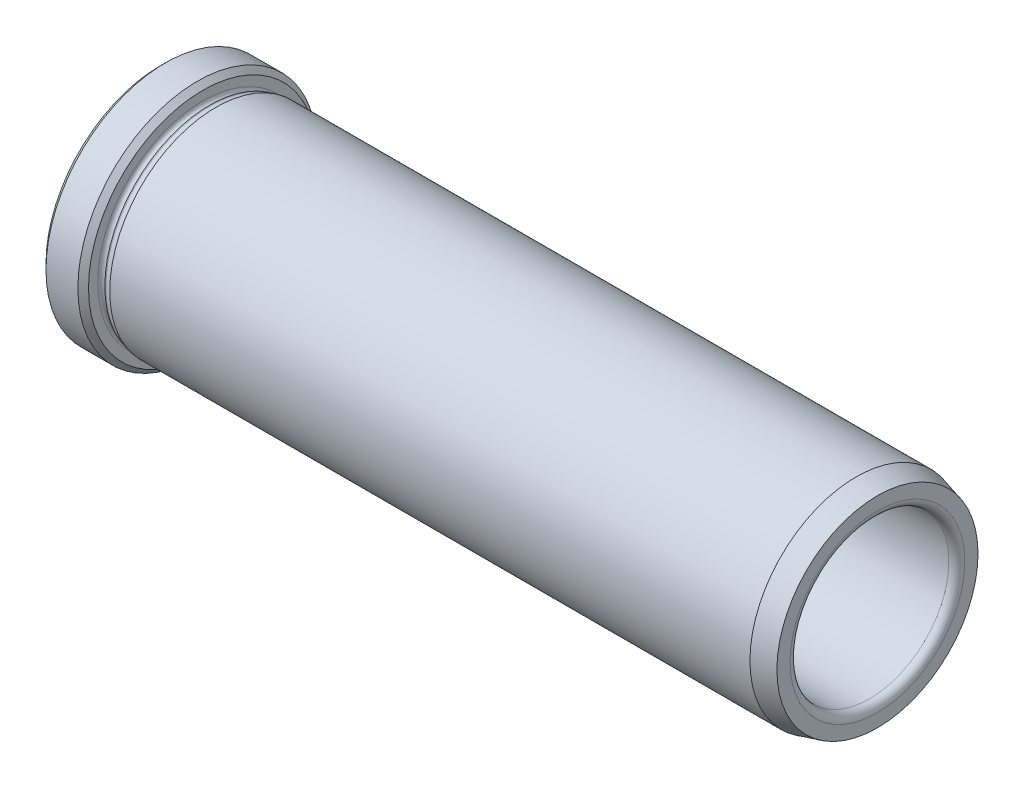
ISO-10303-21;
HEADER;
FILE_DESCRIPTION(('STEP AP214'),'2;1');
FILE_NAME('part.step','',(''),(''),'','','');
FILE_SCHEMA(('AUTOMOTIVE_DESIGN { 1 0 10303 214 1 1 1 1 }'));
ENDSEC;
DATA;
#1=APPLICATION_CONTEXT('core data for automotive mechanical design processes');
#2=APPLICATION_PROTOCOL_DEFINITION('international standard','automotive_design',2000,#1);
#3=PRODUCT_CONTEXT('',#1,'mechanical');
#4=PRODUCT('Part','Part','',(#3));
#5=PRODUCT_RELATED_PRODUCT_CATEGORY('part','',(#4));
#6=PRODUCT_DEFINITION_FORMATION('','',#4);
#7=PRODUCT_DEFINITION_CONTEXT('part definition',#1,'design');
#8=PRODUCT_DEFINITION('design','',#6,#7);
#9=PRODUCT_DEFINITION_SHAPE('','',#8);
#10=(LENGTH_UNIT() NAMED_UNIT(*) SI_UNIT(.MILLI.,.METRE.));
#11=(NAMED_UNIT(*) PLANE_ANGLE_UNIT() SI_UNIT($,.RADIAN.));
#12=(NAMED_UNIT(*) SI_UNIT($,.STERADIAN.) SOLID_ANGLE_UNIT());
#13=UNCERTAINTY_MEASURE_WITH_UNIT(LENGTH_MEASURE(1.E-05),#10,'distance_accuracy_value','');
#14=(GEOMETRIC_REPRESENTATION_CONTEXT(3) GLOBAL_UNCERTAINTY_ASSIGNED_CONTEXT((#13)) GLOBAL_UNIT_ASSIGNED_CONTEXT((#10,
#11,#12)) REPRESENTATION_CONTEXT('',''));
#15=CARTESIAN_POINT('',(0.,0.,0.));
#16=DIRECTION('',(0.,0.,1.));
#17=DIRECTION('',(1.,0.,0.));
#18=AXIS2_PLACEMENT_3D('',#15,#16,#17);
#19=CARTESIAN_POINT('',(30.9097582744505,14.95,0.));
#20=DIRECTION('',(1.,0.,0.));
#21=DIRECTION('',(0.,0.,-1.));
#22=AXIS2_PLACEMENT_3D('',#19,#20,#21);
#23=PLANE('',#22);
#24=CARTESIAN_POINT('',(30.9097582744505,0.,0.));
#25=DIRECTION('',(-1.,0.,0.));
#26=DIRECTION('',(0.,0.,1.));
#27=AXIS2_PLACEMENT_3D('',#24,#25,#26);
#28=CIRCLE('',#27,14.95);
#29=CARTESIAN_POINT('',(30.9097582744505,0.,14.95));
#30=VERTEX_POINT('',#29);
#31=EDGE_CURVE('E46',#30,#30,#28,.T.);
#32=ORIENTED_EDGE('',*,*,#31,.F.);
#33=EDGE_LOOP('',(#32));
#34=FACE_BOUND('',#33,.T.);
#35=CARTESIAN_POINT('',(30.9097582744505,0.,0.));
#36=DIRECTION('',(-1.,0.,0.));
#37=DIRECTION('',(0.,0.,1.));
#38=AXIS2_PLACEMENT_3D('',#35,#36,#37);
#39=CIRCLE('',#38,15.);
#40=CARTESIAN_POINT('',(30.9097582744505,0.,15.));
#41=VERTEX_POINT('',#40);
#42=EDGE_CURVE('E70',#41,#41,#39,.T.);
#43=ORIENTED_EDGE('',*,*,#42,.T.);
#44=EDGE_LOOP('',(#43));
#45=FACE_BOUND('',#44,.T.);
#46=ADVANCED_FACE('F14',(#34,#45),#23,.F.);
#47=CARTESIAN_POINT('',(0.,0.,0.));
#48=DIRECTION('',(-1.,0.,0.));
#49=DIRECTION('',(0.,0.,1.));
#50=AXIS2_PLACEMENT_3D('',#47,#48,#49);
#51=CYLINDRICAL_SURFACE('',#50,14.95);
#52=CARTESIAN_POINT('',(124.40975827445,0.,0.));
#53=DIRECTION('',(-1.,0.,0.));
#54=DIRECTION('',(0.,0.,1.));
#55=AXIS2_PLACEMENT_3D('',#52,#53,#54);
#56=CIRCLE('',#55,14.95);
#57=CARTESIAN_POINT('',(124.40975827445,0.,14.95));
#58=VERTEX_POINT('',#57);
#59=EDGE_CURVE('E34',#58,#58,#56,.F.);
#60=ORIENTED_EDGE('',*,*,#59,.T.);
#61=EDGE_LOOP('',(#60));
#62=FACE_BOUND('',#61,.T.);
#63=ORIENTED_EDGE('',*,*,#31,.T.);
#64=EDGE_LOOP('',(#63));
#65=FACE_BOUND('',#64,.T.);
#66=ADVANCED_FACE('F94',(#62,#65),#51,.F.);
#67=CARTESIAN_POINT('',(125.90975827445,18.9282032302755,0.));
#68=DIRECTION('',(-1.,0.,0.));
#69=DIRECTION('',(0.,0.,1.));
#70=AXIS2_PLACEMENT_3D('',#67,#68,#69);
#71=PLANE('',#70);
#72=CARTESIAN_POINT('',(125.90975827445,0.,0.));
#73=DIRECTION('',(-1.,0.,0.));
#74=DIRECTION('',(0.,0.,1.));
#75=AXIS2_PLACEMENT_3D('',#72,#73,#74);
#76=CIRCLE('',#75,16.45);
#77=CARTESIAN_POINT('',(125.90975827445,0.,16.45));
#78=VERTEX_POINT('',#77);
#79=EDGE_CURVE('E37',#78,#78,#76,.T.);
#80=ORIENTED_EDGE('',*,*,#79,.T.);
#81=EDGE_LOOP('',(#80));
#82=FACE_BOUND('',#81,.T.);
#83=CARTESIAN_POINT('',(125.90975827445,0.,0.));
#84=DIRECTION('',(-1.,0.,0.));
#85=DIRECTION('',(0.,0.,1.));
#86=AXIS2_PLACEMENT_3D('',#83,#84,#85);
#87=CIRCLE('',#86,18.9282032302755);
#88=CARTESIAN_POINT('',(125.90975827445,0.,18.9282032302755));
#89=VERTEX_POINT('',#88);
#90=EDGE_CURVE('E49',#89,#89,#87,.T.);
#91=ORIENTED_EDGE('',*,*,#90,.F.);
#92=EDGE_LOOP('',(#91));
#93=FACE_BOUND('',#92,.T.);
#94=ADVANCED_FACE('F101',(#82,#93),#71,.F.);
#95=CARTESIAN_POINT('',(125.90975827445,0.,0.));
#96=DIRECTION('',(-1.,0.,0.));
#97=DIRECTION('',(0.,0.,1.));
#98=AXIS2_PLACEMENT_3D('',#95,#96,#97);
#99=CONICAL_SURFACE('',#98,18.9282032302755,0.261799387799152);
#100=CARTESIAN_POINT('',(121.90975827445,0.,0.));
#101=DIRECTION('',(-1.,0.,0.));
#102=DIRECTION('',(0.,0.,1.));
#103=AXIS2_PLACEMENT_3D('',#100,#101,#102);
#104=CIRCLE('',#103,20.);
#105=CARTESIAN_POINT('',(121.90975827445,0.,20.));
#106=VERTEX_POINT('',#105);
#107=EDGE_CURVE('E52',#106,#106,#104,.T.);
#108=ORIENTED_EDGE('',*,*,#107,.F.);
#109=EDGE_LOOP('',(#108));
#110=FACE_BOUND('',#109,.T.);
#111=ORIENTED_EDGE('',*,*,#90,.T.);
#112=EDGE_LOOP('',(#111));
#113=FACE_BOUND('',#112,.T.);
#114=ADVANCED_FACE('F165',(#110,#113),#99,.T.);
#115=CARTESIAN_POINT('',(0.,0.,0.));
#116=DIRECTION('',(-1.,0.,0.));
#117=DIRECTION('',(0.,0.,1.));
#118=AXIS2_PLACEMENT_3D('',#115,#116,#117);
#119=CYLINDRICAL_SURFACE('',#118,20.);
#120=CARTESIAN_POINT('',(1.40975827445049,0.,0.));
#121=DIRECTION('',(-1.,0.,0.));
#122=DIRECTION('',(0.,0.,1.));
#123=AXIS2_PLACEMENT_3D('',#120,#121,#122);
#124=CIRCLE('',#123,20.);
#125=CARTESIAN_POINT('',(1.40975827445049,0.,20.));
#126=VERTEX_POINT('',#125);
#127=EDGE_CURVE('E55',#126,#126,#124,.T.);
#128=ORIENTED_EDGE('',*,*,#127,.F.);
#129=EDGE_LOOP('',(#128));
#130=FACE_BOUND('',#129,.T.);
#131=ORIENTED_EDGE('',*,*,#107,.T.);
#132=EDGE_LOOP('',(#131));
#133=FACE_BOUND('',#132,.T.);
#134=ADVANCED_FACE('F205',(#130,#133),#119,.T.);
#135=CARTESIAN_POINT('',(1.40975827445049,0.,0.));
#136=DIRECTION('',(1.,0.,0.));
#137=DIRECTION('',(0.,0.,-1.));
#138=AXIS2_PLACEMENT_3D('',#135,#136,#137);
#139=CONICAL_SURFACE('',#138,20.,0.261799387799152);
#140=CARTESIAN_POINT('',(0.391876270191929,0.,0.));
#141=DIRECTION('',(-1.,0.,0.));
#142=DIRECTION('',(0.,0.,1.));
#143=AXIS2_PLACEMENT_3D('',#140,#141,#142);
#144=CIRCLE('',#143,19.7272593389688);
#145=CARTESIAN_POINT('',(0.391876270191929,0.,19.7272593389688));
#146=VERTEX_POINT('',#145);
#147=EDGE_CURVE('E58',#146,#146,#144,.T.);
#148=ORIENTED_EDGE('',*,*,#147,.F.);
#149=EDGE_LOOP('',(#148));
#150=FACE_BOUND('',#149,.T.);
#151=ORIENTED_EDGE('',*,*,#127,.T.);
#152=EDGE_LOOP('',(#151));
#153=FACE_BOUND('',#152,.T.);
#154=ADVANCED_FACE('F195',(#150,#153),#139,.T.);
#155=CARTESIAN_POINT('',(0.184821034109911,0.,0.));
#156=DIRECTION('',(-1.,0.,0.));
#157=DIRECTION('',(0.,0.,1.));
#158=AXIS2_PLACEMENT_3D('',#155,#156,#157);
#159=TOROIDAL_SURFACE('',#158,20.5,0.8);
#160=CARTESIAN_POINT('',(0.184821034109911,0.,0.));
#161=DIRECTION('',(-1.,0.,0.));
#162=DIRECTION('',(0.,0.,1.));
#163=AXIS2_PLACEMENT_3D('',#160,#161,#162);
#164=CIRCLE('',#163,19.7);
#165=CARTESIAN_POINT('',(0.184821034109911,0.,19.7));
#166=VERTEX_POINT('',#165);
#167=EDGE_CURVE('E61',#166,#166,#164,.T.);
#168=ORIENTED_EDGE('',*,*,#167,.F.);
#169=EDGE_LOOP('',(#168));
#170=FACE_BOUND('',#169,.T.);
#171=ORIENTED_EDGE('',*,*,#147,.T.);
#172=EDGE_LOOP('',(#171));
#173=FACE_BOUND('',#172,.T.);
#174=ADVANCED_FACE('F185',(#170,#173),#159,.F.);
#175=CARTESIAN_POINT('',(0.,0.,0.));
#176=DIRECTION('',(-1.,0.,0.));
#177=DIRECTION('',(0.,0.,1.));
#178=AXIS2_PLACEMENT_3D('',#175,#176,#177);
#179=CYLINDRICAL_SURFACE('',#178,19.7);
#180=CARTESIAN_POINT('',(0.507210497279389,0.,0.));
#181=DIRECTION('',(-1.,0.,0.));
#182=DIRECTION('',(0.,0.,1.));
#183=AXIS2_PLACEMENT_3D('',#180,#181,#182);
#184=CIRCLE('',#183,19.7);
#185=CARTESIAN_POINT('',(0.507210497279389,0.,19.7));
#186=VERTEX_POINT('',#185);
#187=EDGE_CURVE('E64',#186,#186,#184,.T.);
#188=ORIENTED_EDGE('',*,*,#187,.F.);
#189=EDGE_LOOP('',(#188));
#190=FACE_BOUND('',#189,.T.);
#191=ORIENTED_EDGE('',*,*,#167,.T.);
#192=EDGE_LOOP('',(#191));
#193=FACE_BOUND('',#192,.T.);
#194=ADVANCED_FACE('F175',(#190,#193),#179,.F.);
#195=CARTESIAN_POINT('',(-0.290241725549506,0.,0.));
#196=DIRECTION('',(-1.,0.,0.));
#197=DIRECTION('',(0.,0.,1.));
#198=AXIS2_PLACEMENT_3D('',#195,#196,#197);
#199=TOROIDAL_SURFACE('',#198,19.7637961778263,0.8);
#200=CARTESIAN_POINT('',(-1.0902417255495,0.,0.));
#201=DIRECTION('',(-1.,0.,0.));
#202=DIRECTION('',(0.,0.,1.));
#203=AXIS2_PLACEMENT_3D('',#200,#201,#202);
#204=CIRCLE('',#203,19.7637961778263);
#205=CARTESIAN_POINT('',(-1.0902417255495,0.,19.7637961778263));
#206=VERTEX_POINT('',#205);
#207=EDGE_CURVE('E67',#206,#206,#204,.T.);
#208=ORIENTED_EDGE('',*,*,#207,.F.);
#209=EDGE_LOOP('',(#208));
#210=FACE_BOUND('',#209,.T.);
#211=ORIENTED_EDGE('',*,*,#187,.T.);
#212=EDGE_LOOP('',(#211));
#213=FACE_BOUND('',#212,.T.);
#214=ADVANCED_FACE('F154',(#210,#213),#199,.F.);
#215=CARTESIAN_POINT('',(-1.0902417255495,22.5,0.));
#216=DIRECTION('',(-1.,0.,0.));
#217=DIRECTION('',(0.,0.,1.));
#218=AXIS2_PLACEMENT_3D('',#215,#216,#217);
#219=PLANE('',#218);
#220=CARTESIAN_POINT('',(-1.0902417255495,0.,0.));
#221=DIRECTION('',(-1.,0.,0.));
#222=DIRECTION('',(0.,0.,1.));
#223=AXIS2_PLACEMENT_3D('',#220,#221,#222);
#224=CIRCLE('',#223,21.5);
#225=CARTESIAN_POINT('',(-1.0902417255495,0.,21.5));
#226=VERTEX_POINT('',#225);
#227=EDGE_CURVE('E9',#226,#226,#224,.F.);
#228=ORIENTED_EDGE('',*,*,#227,.T.);
#229=EDGE_LOOP('',(#228));
#230=FACE_BOUND('',#229,.T.);
#231=ORIENTED_EDGE('',*,*,#207,.T.);
#232=EDGE_LOOP('',(#231));
#233=FACE_BOUND('',#232,.T.);
#234=ADVANCED_FACE('F144',(#230,#233),#219,.F.);
#235=CARTESIAN_POINT('',(0.,0.,0.));
#236=DIRECTION('',(-1.,0.,0.));
#237=DIRECTION('',(0.,0.,1.));
#238=AXIS2_PLACEMENT_3D('',#235,#236,#237);
#239=CYLINDRICAL_SURFACE('',#238,22.5);
#240=CARTESIAN_POINT('',(-2.09024172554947,0.,0.));
#241=DIRECTION('',(-1.,0.,0.));
#242=DIRECTION('',(0.,0.,1.));
#243=AXIS2_PLACEMENT_3D('',#240,#241,#242);
#244=CIRCLE('',#243,22.5);
#245=CARTESIAN_POINT('',(-2.09024172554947,0.,22.5));
#246=VERTEX_POINT('',#245);
#247=EDGE_CURVE('E21',#246,#246,#244,.T.);
#248=ORIENTED_EDGE('',*,*,#247,.T.);
#249=EDGE_LOOP('',(#248));
#250=FACE_BOUND('',#249,.T.);
#251=CARTESIAN_POINT('',(-8.09024172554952,0.,0.));
#252=DIRECTION('',(1.,0.,0.));
#253=DIRECTION('',(0.,0.,-1.));
#254=AXIS2_PLACEMENT_3D('',#251,#252,#253);
#255=CIRCLE('',#254,22.5);
#256=CARTESIAN_POINT('',(-8.09024172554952,0.,-22.5));
#257=VERTEX_POINT('',#256);
#258=EDGE_CURVE('E40',#257,#257,#255,.T.);
#259=ORIENTED_EDGE('',*,*,#258,.T.);
#260=EDGE_LOOP('',(#259));
#261=FACE_BOUND('',#260,.T.);
#262=ADVANCED_FACE('F90',(#250,#261),#239,.T.);
#263=CARTESIAN_POINT('',(-9.09024172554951,22.5,0.));
#264=DIRECTION('',(1.,0.,0.));
#265=DIRECTION('',(0.,0.,-1.));
#266=AXIS2_PLACEMENT_3D('',#263,#264,#265);
#267=PLANE('',#266);
#268=CARTESIAN_POINT('',(-9.09024172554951,0.,0.));
#269=DIRECTION('',(1.,0.,0.));
#270=DIRECTION('',(0.,0.,-1.));
#271=AXIS2_PLACEMENT_3D('',#268,#269,#270);
#272=CIRCLE('',#271,16.5);
#273=CARTESIAN_POINT('',(-9.09024172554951,0.,-16.5));
#274=VERTEX_POINT('',#273);
#275=EDGE_CURVE('E25',#274,#274,#272,.T.);
#276=ORIENTED_EDGE('',*,*,#275,.T.);
#277=EDGE_LOOP('',(#276));
#278=FACE_BOUND('',#277,.T.);
#279=CARTESIAN_POINT('',(-9.09024172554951,0.,0.));
#280=DIRECTION('',(1.,0.,0.));
#281=DIRECTION('',(0.,0.,-1.));
#282=AXIS2_PLACEMENT_3D('',#279,#280,#281);
#283=CIRCLE('',#282,21.5);
#284=CARTESIAN_POINT('',(-9.09024172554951,0.,-21.5));
#285=VERTEX_POINT('',#284);
#286=EDGE_CURVE('E43',#285,#285,#283,.F.);
#287=ORIENTED_EDGE('',*,*,#286,.T.);
#288=EDGE_LOOP('',(#287));
#289=FACE_BOUND('',#288,.T.);
#290=ADVANCED_FACE('F78',(#278,#289),#267,.F.);
#291=CARTESIAN_POINT('',(0.,0.,0.));
#292=DIRECTION('',(-1.,0.,0.));
#293=DIRECTION('',(0.,0.,1.));
#294=AXIS2_PLACEMENT_3D('',#291,#292,#293);
#295=CYLINDRICAL_SURFACE('',#294,15.);
#296=CARTESIAN_POINT('',(-7.59024172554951,0.,0.));
#297=DIRECTION('',(1.,0.,0.));
#298=DIRECTION('',(0.,0.,-1.));
#299=AXIS2_PLACEMENT_3D('',#296,#297,#298);
#300=CIRCLE('',#299,15.);
#301=CARTESIAN_POINT('',(-7.59024172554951,0.,-15.));
#302=VERTEX_POINT('',#301);
#303=EDGE_CURVE('E29',#302,#302,#300,.F.);
#304=ORIENTED_EDGE('',*,*,#303,.T.);
#305=EDGE_LOOP('',(#304));
#306=FACE_BOUND('',#305,.T.);
#307=ORIENTED_EDGE('',*,*,#42,.F.);
#308=EDGE_LOOP('',(#307));
#309=FACE_BOUND('',#308,.T.);
#310=ADVANCED_FACE('F75',(#306,#309),#295,.F.);
#311=CARTESIAN_POINT('',(-9.09024172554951,0.,0.));
#312=DIRECTION('',(1.,0.,0.));
#313=DIRECTION('',(0.,0.,-1.));
#314=AXIS2_PLACEMENT_3D('',#311,#312,#313);
#315=CONICAL_SURFACE('',#314,21.5,0.785398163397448);
#316=ORIENTED_EDGE('',*,*,#258,.F.);
#317=EDGE_LOOP('',(#316));
#318=FACE_BOUND('',#317,.T.);
#319=ORIENTED_EDGE('',*,*,#286,.F.);
#320=EDGE_LOOP('',(#319));
#321=FACE_BOUND('',#320,.T.);
#322=ADVANCED_FACE('F77',(#318,#321),#315,.T.);
#323=CARTESIAN_POINT('',(124.40975827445,0.,0.));
#324=DIRECTION('',(-1.,0.,0.));
#325=DIRECTION('',(0.,0.,1.));
#326=AXIS2_PLACEMENT_3D('',#323,#324,#325);
#327=TOROIDAL_SURFACE('',#326,16.45,1.5);
#328=ORIENTED_EDGE('',*,*,#59,.F.);
#329=EDGE_LOOP('',(#328));
#330=FACE_BOUND('',#329,.T.);
#331=ORIENTED_EDGE('',*,*,#79,.F.);
#332=EDGE_LOOP('',(#331));
#333=FACE_BOUND('',#332,.T.);
#334=ADVANCED_FACE('F87',(#330,#333),#327,.T.);
#335=CARTESIAN_POINT('',(-7.59024172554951,0.,0.));
#336=DIRECTION('',(1.,0.,0.));
#337=DIRECTION('',(0.,0.,-1.));
#338=AXIS2_PLACEMENT_3D('',#335,#336,#337);
#339=TOROIDAL_SURFACE('',#338,16.5,1.5);
#340=ORIENTED_EDGE('',*,*,#275,.F.);
#341=EDGE_LOOP('',(#340));
#342=FACE_BOUND('',#341,.T.);
#343=ORIENTED_EDGE('',*,*,#303,.F.);
#344=EDGE_LOOP('',(#343));
#345=FACE_BOUND('',#344,.T.);
#346=ADVANCED_FACE('F108',(#342,#345),#339,.T.);
#347=CARTESIAN_POINT('',(-2.09024172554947,0.,0.));
#348=DIRECTION('',(-1.,0.,0.));
#349=DIRECTION('',(0.,0.,1.));
#350=AXIS2_PLACEMENT_3D('',#347,#348,#349);
#351=CONICAL_SURFACE('',#350,22.5,0.785398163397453);
#352=ORIENTED_EDGE('',*,*,#227,.F.);
#353=EDGE_LOOP('',(#352));
#354=FACE_BOUND('',#353,.T.);
#355=ORIENTED_EDGE('',*,*,#247,.F.);
#356=EDGE_LOOP('',(#355));
#357=FACE_BOUND('',#356,.T.);
#358=ADVANCED_FACE('F16',(#354,#357),#351,.T.);
#359=CLOSED_SHELL('',(#46,#66,#94,#114,#134,#154,#174,#194,#214,#234,#262,#290,#310,#322,#334,
#346,#358));
#360=MANIFOLD_SOLID_BREP('B1',#359);
#361=ADVANCED_BREP_SHAPE_REPRESENTATION('',(#18,#360),#14);
#362=SHAPE_DEFINITION_REPRESENTATION(#9,#361);
ENDSEC;
END-ISO-10303-21;
